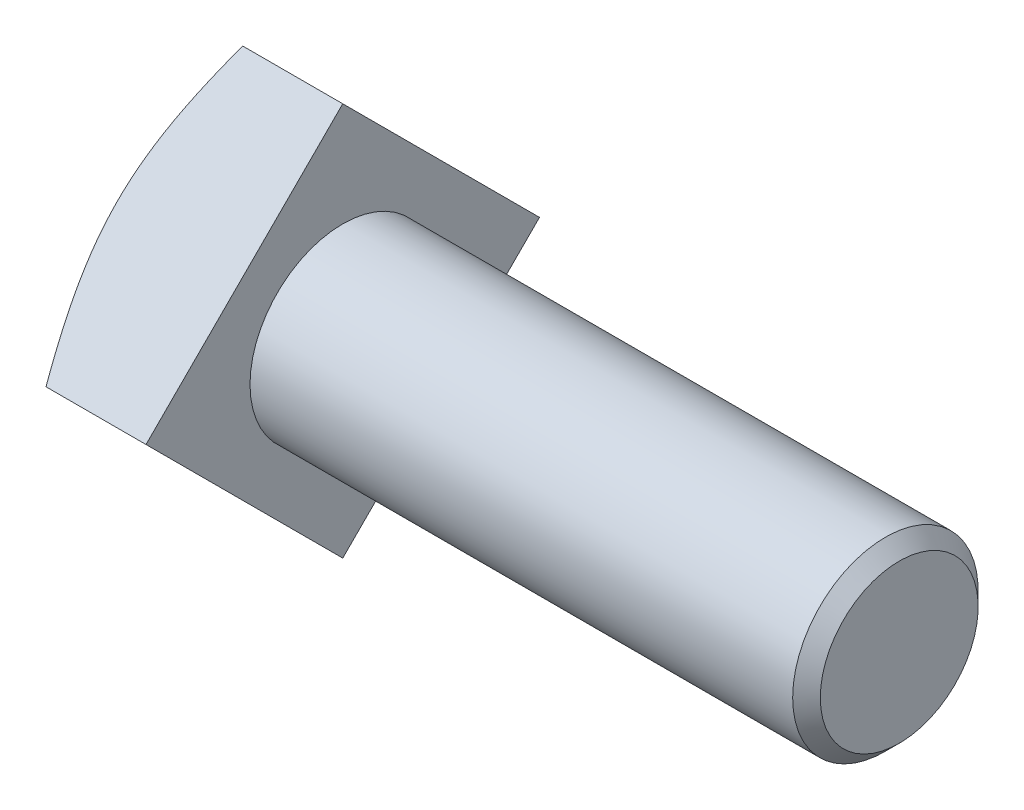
from build123d import *

# Parameters (mm, degrees)
SKETCH1_W      = 38.1
SKETCH1_H      = 38.1
BASEHEAD_DEPTH = 17.3736


with BuildPart() as part:
    # Sketch1 → BaseHead (new body)
    with BuildSketch(Plane(origin=(0, 0, 0), x_dir=(0, 0.7071067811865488, -0.7071067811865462), z_dir=(1, 0, 0))):
        Rectangle(SKETCH1_W, SKETCH1_H)
    extrude(amount=BASEHEAD_DEPTH)

    # BodySke → Body (revolve)
    with BuildSketch(Plane.XY, mode=Mode.PRIVATE) as body_sk:
        Polygon((17.3736, 0), (17.3736, 12.7), (91.6813, 12.7), (93.5736, 10.8077), (93.5736, 0), align=None)
    revolve(body_sk.sketch.rotate(Axis((0, 0, 0), (1, 0, 0)), 90), axis=Axis((0, 0, 0), (1, 0, 0)))

    # Sketch3 → HeadChamfer (revolve, cut)
    with BuildSketch(Plane.XY):
        Polygon((0, 19.05), (-12.7, 19.05), (-12.7, 52.340768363), (15.523740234, 52.340768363), align=None)
    revolve(axis=Axis((0, 0, 0), (1, 0, 0)), mode=Mode.SUBTRACT)


solid = part.part
